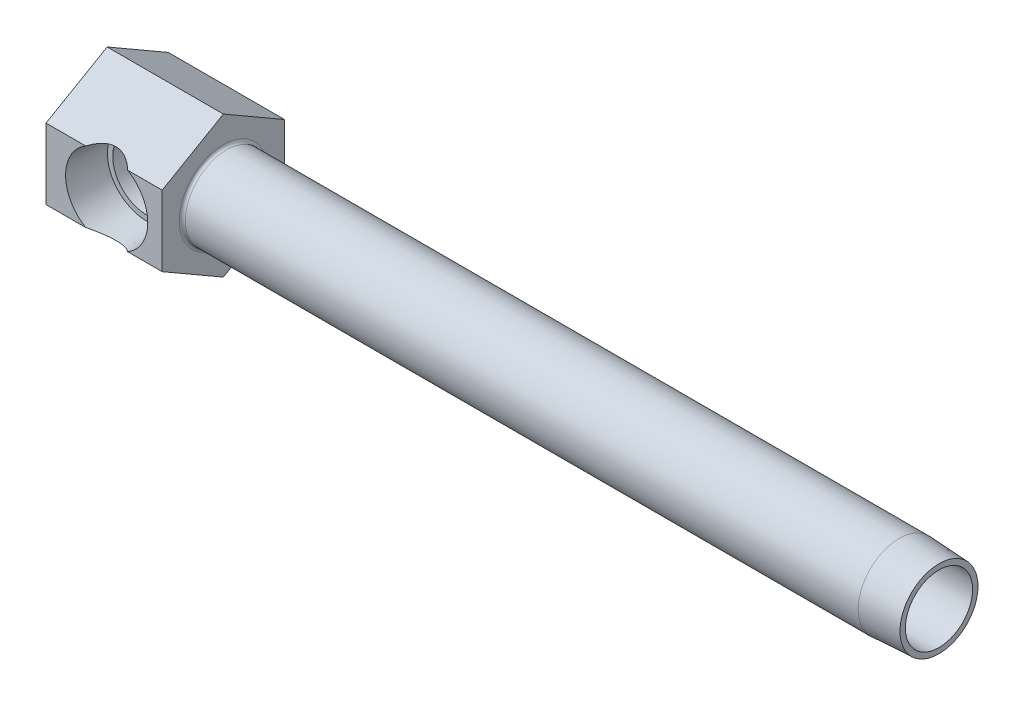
ISO-10303-21;
HEADER;
FILE_DESCRIPTION(('STEP AP214'),'2;1');
FILE_NAME('part.step','',(''),(''),'','','');
FILE_SCHEMA(('AUTOMOTIVE_DESIGN { 1 0 10303 214 1 1 1 1 }'));
ENDSEC;
DATA;
#1=APPLICATION_CONTEXT('core data for automotive mechanical design processes');
#2=APPLICATION_PROTOCOL_DEFINITION('international standard','automotive_design',2000,#1);
#3=PRODUCT_CONTEXT('',#1,'mechanical');
#4=PRODUCT('Part','Part','',(#3));
#5=PRODUCT_RELATED_PRODUCT_CATEGORY('part','',(#4));
#6=PRODUCT_DEFINITION_FORMATION('','',#4);
#7=PRODUCT_DEFINITION_CONTEXT('part definition',#1,'design');
#8=PRODUCT_DEFINITION('design','',#6,#7);
#9=PRODUCT_DEFINITION_SHAPE('','',#8);
#10=(LENGTH_UNIT() NAMED_UNIT(*) SI_UNIT(.MILLI.,.METRE.));
#11=(NAMED_UNIT(*) PLANE_ANGLE_UNIT() SI_UNIT($,.RADIAN.));
#12=(NAMED_UNIT(*) SI_UNIT($,.STERADIAN.) SOLID_ANGLE_UNIT());
#13=UNCERTAINTY_MEASURE_WITH_UNIT(LENGTH_MEASURE(1.E-05),#10,'distance_accuracy_value','');
#14=(GEOMETRIC_REPRESENTATION_CONTEXT(3) GLOBAL_UNCERTAINTY_ASSIGNED_CONTEXT((#13)) GLOBAL_UNIT_ASSIGNED_CONTEXT((#10,
#11,#12)) REPRESENTATION_CONTEXT('',''));
#15=CARTESIAN_POINT('',(0.,0.,0.));
#16=DIRECTION('',(0.,0.,1.));
#17=DIRECTION('',(1.,0.,0.));
#18=AXIS2_PLACEMENT_3D('',#15,#16,#17);
#19=CARTESIAN_POINT('',(63.5,0.,15.875));
#20=DIRECTION('',(-1.,0.,0.));
#21=DIRECTION('',(0.,0.,1.));
#22=AXIS2_PLACEMENT_3D('',#19,#20,#21);
#23=CYLINDRICAL_SURFACE('',#22,10.668);
#24=CARTESIAN_POINT('',(30.9499,0.,15.875));
#25=DIRECTION('',(1.,0.,0.));
#26=DIRECTION('',(0.,1.,0.));
#27=AXIS2_PLACEMENT_3D('',#24,#25,#26);
#28=CIRCLE('',#27,10.668);
#29=CARTESIAN_POINT('',(30.9499,10.668,15.875));
#30=VERTEX_POINT('',#29);
#31=EDGE_CURVE('E191',#30,#30,#28,.T.);
#32=ORIENTED_EDGE('',*,*,#31,.T.);
#33=EDGE_LOOP('',(#32));
#34=FACE_BOUND('',#33,.T.);
#35=CARTESIAN_POINT('',(205.5876,0.,15.875));
#36=DIRECTION('',(1.,0.,0.));
#37=DIRECTION('',(0.,0.,-1.));
#38=AXIS2_PLACEMENT_3D('',#35,#36,#37);
#39=CIRCLE('',#38,10.668);
#40=CARTESIAN_POINT('',(205.5876,0.,5.207));
#41=VERTEX_POINT('',#40);
#42=EDGE_CURVE('E256',#41,#41,#39,.T.);
#43=ORIENTED_EDGE('',*,*,#42,.F.);
#44=EDGE_LOOP('',(#43));
#45=FACE_BOUND('',#44,.T.);
#46=ADVANCED_FACE('F15',(#34,#45),#23,.T.);
#47=CARTESIAN_POINT('',(30.1625,18.3308710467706,15.875));
#48=DIRECTION('',(0.,-0.866025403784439,-0.5));
#49=DIRECTION('',(0.,0.5,-0.866025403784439));
#50=AXIS2_PLACEMENT_3D('',#47,#48,#49);
#51=PLANE('',#50);
#52=CARTESIAN_POINT('',(15.748,-1.05255916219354,49.4480859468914));
#53=DIRECTION('',(0.,-0.866025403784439,-0.5));
#54=DIRECTION('',(0.,-0.5,0.866025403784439));
#55=AXIS2_PLACEMENT_3D('',#52,#53,#54);
#56=ELLIPSE('',#55,23.191034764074,11.5476466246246);
#57=CARTESIAN_POINT('',(21.2070306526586,9.16543552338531,31.75));
#58=VERTEX_POINT('',#57);
#59=CARTESIAN_POINT('',(10.2889693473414,9.16543552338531,31.75));
#60=VERTEX_POINT('',#59);
#61=EDGE_CURVE('E135',#58,#60,#56,.F.);
#62=ORIENTED_EDGE('',*,*,#61,.F.);
#63=DIRECTION('',(-1.,0.,0.));
#64=VECTOR('',#63,1.);
#65=CARTESIAN_POINT('',(30.1625,9.16543552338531,31.75));
#66=LINE('',#65,#64);
#67=CARTESIAN_POINT('',(30.1625,9.16543552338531,31.75));
#68=VERTEX_POINT('',#67);
#69=EDGE_CURVE('E179',#68,#58,#66,.T.);
#70=ORIENTED_EDGE('',*,*,#69,.F.);
#71=DIRECTION('',(0.,-0.5,0.866025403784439));
#72=VECTOR('',#71,1.);
#73=CARTESIAN_POINT('',(30.1625,18.3308710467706,15.875));
#74=LINE('',#73,#72);
#75=CARTESIAN_POINT('',(30.1625,18.3308710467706,15.875));
#76=VERTEX_POINT('',#75);
#77=EDGE_CURVE('E163',#76,#68,#74,.T.);
#78=ORIENTED_EDGE('',*,*,#77,.F.);
#79=DIRECTION('',(-1.,0.,0.));
#80=VECTOR('',#79,1.);
#81=CARTESIAN_POINT('',(30.1625,18.3308710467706,15.875));
#82=LINE('',#81,#80);
#83=CARTESIAN_POINT('',(0.,18.3308710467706,15.875));
#84=VERTEX_POINT('',#83);
#85=EDGE_CURVE('E182',#76,#84,#82,.T.);
#86=ORIENTED_EDGE('',*,*,#85,.T.);
#87=DIRECTION('',(0.,-0.5,0.866025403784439));
#88=VECTOR('',#87,1.);
#89=CARTESIAN_POINT('',(0.,18.3308710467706,15.875));
#90=LINE('',#89,#88);
#91=CARTESIAN_POINT('',(0.,9.16543552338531,31.75));
#92=VERTEX_POINT('',#91);
#93=EDGE_CURVE('E144',#84,#92,#90,.T.);
#94=ORIENTED_EDGE('',*,*,#93,.T.);
#95=EDGE_CURVE('E178',#60,#92,#66,.T.);
#96=ORIENTED_EDGE('',*,*,#95,.F.);
#97=EDGE_LOOP('',(#62,#70,#78,#86,#94,#96));
#98=FACE_BOUND('',#97,.T.);
#99=ADVANCED_FACE('F210',(#98),#51,.F.);
#100=CARTESIAN_POINT('',(30.1625,9.16543552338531,31.75));
#101=DIRECTION('',(0.,0.,-1.));
#102=DIRECTION('',(-1.,0.,0.));
#103=AXIS2_PLACEMENT_3D('',#100,#101,#102);
#104=PLANE('',#103);
#105=CARTESIAN_POINT('',(15.748,0.,31.75));
#106=DIRECTION('',(0.,0.,-1.));
#107=DIRECTION('',(-1.,0.,0.));
#108=AXIS2_PLACEMENT_3D('',#105,#106,#107);
#109=CIRCLE('',#108,10.668);
#110=CARTESIAN_POINT('',(21.2070306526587,-9.1654355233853,31.75));
#111=VERTEX_POINT('',#110);
#112=EDGE_CURVE('E133',#58,#111,#109,.T.);
#113=ORIENTED_EDGE('',*,*,#112,.T.);
#114=DIRECTION('',(-1.,0.,0.));
#115=VECTOR('',#114,1.);
#116=CARTESIAN_POINT('',(30.1625,-9.1654355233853,31.75));
#117=LINE('',#116,#115);
#118=CARTESIAN_POINT('',(30.1625,-9.1654355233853,31.75));
#119=VERTEX_POINT('',#118);
#120=EDGE_CURVE('E175',#119,#111,#117,.T.);
#121=ORIENTED_EDGE('',*,*,#120,.F.);
#122=DIRECTION('',(0.,-1.,0.));
#123=VECTOR('',#122,1.);
#124=CARTESIAN_POINT('',(30.1625,9.16543552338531,31.75));
#125=LINE('',#124,#123);
#126=EDGE_CURVE('E165',#68,#119,#125,.T.);
#127=ORIENTED_EDGE('',*,*,#126,.F.);
#128=ORIENTED_EDGE('',*,*,#69,.T.);
#129=EDGE_LOOP('',(#113,#121,#127,#128));
#130=FACE_BOUND('',#129,.T.);
#131=ADVANCED_FACE('F206',(#130),#104,.F.);
#132=CARTESIAN_POINT('',(10.2889693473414,-9.1654355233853,31.75));
#133=VERTEX_POINT('',#132);
#134=EDGE_CURVE('E40',#133,#60,#109,.T.);
#135=ORIENTED_EDGE('',*,*,#134,.T.);
#136=ORIENTED_EDGE('',*,*,#95,.T.);
#137=DIRECTION('',(0.,-1.,0.));
#138=VECTOR('',#137,1.);
#139=CARTESIAN_POINT('',(0.,9.16543552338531,31.75));
#140=LINE('',#139,#138);
#141=CARTESIAN_POINT('',(0.,-9.1654355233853,31.75));
#142=VERTEX_POINT('',#141);
#143=EDGE_CURVE('E148',#92,#142,#140,.T.);
#144=ORIENTED_EDGE('',*,*,#143,.T.);
#145=EDGE_CURVE('E174',#133,#142,#117,.T.);
#146=ORIENTED_EDGE('',*,*,#145,.F.);
#147=EDGE_LOOP('',(#135,#136,#144,#146));
#148=FACE_BOUND('',#147,.T.);
#149=ADVANCED_FACE('F213',(#148),#104,.F.);
#150=CARTESIAN_POINT('',(30.1625,-9.1654355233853,31.75));
#151=DIRECTION('',(0.,0.866025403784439,-0.5));
#152=DIRECTION('',(0.,0.5,0.866025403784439));
#153=AXIS2_PLACEMENT_3D('',#150,#151,#152);
#154=PLANE('',#153);
#155=CARTESIAN_POINT('',(15.748,1.05255916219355,49.4480859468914));
#156=DIRECTION('',(0.,0.866025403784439,-0.5));
#157=DIRECTION('',(0.,0.5,0.866025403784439));
#158=AXIS2_PLACEMENT_3D('',#155,#156,#157);
#159=ELLIPSE('',#158,23.191034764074,11.5476466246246);
#160=EDGE_CURVE('E26',#133,#111,#159,.F.);
#161=ORIENTED_EDGE('',*,*,#160,.F.);
#162=ORIENTED_EDGE('',*,*,#145,.T.);
#163=DIRECTION('',(0.,-0.5,-0.866025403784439));
#164=VECTOR('',#163,1.);
#165=CARTESIAN_POINT('',(0.,-9.1654355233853,31.75));
#166=LINE('',#165,#164);
#167=CARTESIAN_POINT('',(0.,-18.3308710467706,15.875));
#168=VERTEX_POINT('',#167);
#169=EDGE_CURVE('E152',#142,#168,#166,.T.);
#170=ORIENTED_EDGE('',*,*,#169,.T.);
#171=DIRECTION('',(-1.,0.,0.));
#172=VECTOR('',#171,1.);
#173=CARTESIAN_POINT('',(30.1625,-18.3308710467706,15.875));
#174=LINE('',#173,#172);
#175=CARTESIAN_POINT('',(30.1625,-18.3308710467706,15.875));
#176=VERTEX_POINT('',#175);
#177=EDGE_CURVE('E169',#176,#168,#174,.T.);
#178=ORIENTED_EDGE('',*,*,#177,.F.);
#179=DIRECTION('',(0.,-0.5,-0.866025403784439));
#180=VECTOR('',#179,1.);
#181=CARTESIAN_POINT('',(30.1625,-9.1654355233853,31.75));
#182=LINE('',#181,#180);
#183=EDGE_CURVE('E167',#119,#176,#182,.T.);
#184=ORIENTED_EDGE('',*,*,#183,.F.);
#185=ORIENTED_EDGE('',*,*,#120,.T.);
#186=EDGE_LOOP('',(#161,#162,#170,#178,#184,#185));
#187=FACE_BOUND('',#186,.T.);
#188=ADVANCED_FACE('F202',(#187),#154,.F.);
#189=CARTESIAN_POINT('',(30.1625,-18.3308710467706,15.875));
#190=DIRECTION('',(0.,0.866025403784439,0.5));
#191=DIRECTION('',(0.,-0.5,0.866025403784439));
#192=AXIS2_PLACEMENT_3D('',#189,#190,#191);
#193=PLANE('',#192);
#194=DIRECTION('',(0.,0.5,-0.866025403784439));
#195=VECTOR('',#194,1.);
#196=CARTESIAN_POINT('',(0.,-18.3308710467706,15.875));
#197=LINE('',#196,#195);
#198=CARTESIAN_POINT('',(0.,-9.16543552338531,0.));
#199=VERTEX_POINT('',#198);
#200=EDGE_CURVE('E137',#168,#199,#197,.T.);
#201=ORIENTED_EDGE('',*,*,#200,.T.);
#202=DIRECTION('',(-1.,0.,0.));
#203=VECTOR('',#202,1.);
#204=CARTESIAN_POINT('',(30.1625,-9.16543552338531,0.));
#205=LINE('',#204,#203);
#206=CARTESIAN_POINT('',(30.1625,-9.16543552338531,0.));
#207=VERTEX_POINT('',#206);
#208=EDGE_CURVE('E188',#207,#199,#205,.T.);
#209=ORIENTED_EDGE('',*,*,#208,.F.);
#210=DIRECTION('',(0.,0.5,-0.866025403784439));
#211=VECTOR('',#210,1.);
#212=CARTESIAN_POINT('',(30.1625,-18.3308710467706,15.875));
#213=LINE('',#212,#211);
#214=EDGE_CURVE('E155',#176,#207,#213,.T.);
#215=ORIENTED_EDGE('',*,*,#214,.F.);
#216=ORIENTED_EDGE('',*,*,#177,.T.);
#217=EDGE_LOOP('',(#201,#209,#215,#216));
#218=FACE_BOUND('',#217,.T.);
#219=ADVANCED_FACE('F220',(#218),#193,.F.);
#220=CARTESIAN_POINT('',(30.1625,-9.16543552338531,0.));
#221=DIRECTION('',(0.,0.,1.));
#222=DIRECTION('',(0.,-1.,0.));
#223=AXIS2_PLACEMENT_3D('',#220,#221,#222);
#224=PLANE('',#223);
#225=DIRECTION('',(0.,1.,0.));
#226=VECTOR('',#225,1.);
#227=CARTESIAN_POINT('',(0.,-9.16543552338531,0.));
#228=LINE('',#227,#226);
#229=CARTESIAN_POINT('',(0.,9.16543552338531,0.));
#230=VERTEX_POINT('',#229);
#231=EDGE_CURVE('E138',#199,#230,#228,.T.);
#232=ORIENTED_EDGE('',*,*,#231,.T.);
#233=DIRECTION('',(-1.,0.,0.));
#234=VECTOR('',#233,1.);
#235=CARTESIAN_POINT('',(30.1625,9.16543552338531,0.));
#236=LINE('',#235,#234);
#237=CARTESIAN_POINT('',(30.1625,9.16543552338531,0.));
#238=VERTEX_POINT('',#237);
#239=EDGE_CURVE('E185',#238,#230,#236,.T.);
#240=ORIENTED_EDGE('',*,*,#239,.F.);
#241=DIRECTION('',(0.,1.,0.));
#242=VECTOR('',#241,1.);
#243=CARTESIAN_POINT('',(30.1625,-9.16543552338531,0.));
#244=LINE('',#243,#242);
#245=EDGE_CURVE('E159',#207,#238,#244,.T.);
#246=ORIENTED_EDGE('',*,*,#245,.F.);
#247=ORIENTED_EDGE('',*,*,#208,.T.);
#248=EDGE_LOOP('',(#232,#240,#246,#247));
#249=FACE_BOUND('',#248,.T.);
#250=ADVANCED_FACE('F227',(#249),#224,.F.);
#251=CARTESIAN_POINT('',(30.1625,9.16543552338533,0.));
#252=DIRECTION('',(0.,-0.86602540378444,0.5));
#253=DIRECTION('',(0.,-0.5,-0.86602540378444));
#254=AXIS2_PLACEMENT_3D('',#251,#252,#253);
#255=PLANE('',#254);
#256=DIRECTION('',(0.,0.5,0.86602540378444));
#257=VECTOR('',#256,1.);
#258=CARTESIAN_POINT('',(0.,9.16543552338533,0.));
#259=LINE('',#258,#257);
#260=EDGE_CURVE('E141',#230,#84,#259,.T.);
#261=ORIENTED_EDGE('',*,*,#260,.T.);
#262=ORIENTED_EDGE('',*,*,#85,.F.);
#263=DIRECTION('',(0.,0.5,0.86602540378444));
#264=VECTOR('',#263,1.);
#265=CARTESIAN_POINT('',(30.1625,9.16543552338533,0.));
#266=LINE('',#265,#264);
#267=EDGE_CURVE('E161',#238,#76,#266,.T.);
#268=ORIENTED_EDGE('',*,*,#267,.F.);
#269=ORIENTED_EDGE('',*,*,#239,.T.);
#270=EDGE_LOOP('',(#261,#262,#268,#269));
#271=FACE_BOUND('',#270,.T.);
#272=ADVANCED_FACE('F233',(#271),#255,.F.);
#273=CARTESIAN_POINT('',(30.1625,-9.16543552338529,0.));
#274=DIRECTION('',(1.,0.,0.));
#275=DIRECTION('',(0.,1.,0.));
#276=AXIS2_PLACEMENT_3D('',#273,#274,#275);
#277=PLANE('',#276);
#278=CARTESIAN_POINT('',(30.1625,0.,15.875));
#279=DIRECTION('',(1.,0.,0.));
#280=DIRECTION('',(0.,1.,0.));
#281=AXIS2_PLACEMENT_3D('',#278,#279,#280);
#282=CIRCLE('',#281,11.4554);
#283=CARTESIAN_POINT('',(30.1625,11.4554,15.875));
#284=VERTEX_POINT('',#283);
#285=EDGE_CURVE('E194',#284,#284,#282,.F.);
#286=ORIENTED_EDGE('',*,*,#285,.T.);
#287=EDGE_LOOP('',(#286));
#288=FACE_BOUND('',#287,.T.);
#289=ORIENTED_EDGE('',*,*,#214,.T.);
#290=ORIENTED_EDGE('',*,*,#245,.T.);
#291=ORIENTED_EDGE('',*,*,#267,.T.);
#292=ORIENTED_EDGE('',*,*,#77,.T.);
#293=ORIENTED_EDGE('',*,*,#126,.T.);
#294=ORIENTED_EDGE('',*,*,#183,.T.);
#295=EDGE_LOOP('',(#289,#290,#291,#292,#293,#294));
#296=FACE_BOUND('',#295,.T.);
#297=ADVANCED_FACE('F230',(#288,#296),#277,.T.);
#298=CARTESIAN_POINT('',(0.,-9.16543552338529,0.));
#299=DIRECTION('',(1.,0.,0.));
#300=DIRECTION('',(0.,1.,0.));
#301=AXIS2_PLACEMENT_3D('',#298,#299,#300);
#302=PLANE('',#301);
#303=ORIENTED_EDGE('',*,*,#200,.F.);
#304=ORIENTED_EDGE('',*,*,#169,.F.);
#305=ORIENTED_EDGE('',*,*,#143,.F.);
#306=ORIENTED_EDGE('',*,*,#93,.F.);
#307=ORIENTED_EDGE('',*,*,#260,.F.);
#308=ORIENTED_EDGE('',*,*,#231,.F.);
#309=EDGE_LOOP('',(#303,#304,#305,#306,#307,#308));
#310=FACE_BOUND('',#309,.T.);
#311=ADVANCED_FACE('F222',(#310),#302,.F.);
#312=CARTESIAN_POINT('',(30.9499,0.,15.875));
#313=DIRECTION('',(1.,0.,0.));
#314=DIRECTION('',(0.,1.,0.));
#315=AXIS2_PLACEMENT_3D('',#312,#313,#314);
#316=TOROIDAL_SURFACE('',#315,11.4554,0.7874);
#317=ORIENTED_EDGE('',*,*,#285,.F.);
#318=EDGE_LOOP('',(#317));
#319=FACE_BOUND('',#318,.T.);
#320=ORIENTED_EDGE('',*,*,#31,.F.);
#321=EDGE_LOOP('',(#320));
#322=FACE_BOUND('',#321,.T.);
#323=ADVANCED_FACE('F331',(#319,#322),#316,.F.);
#324=CARTESIAN_POINT('',(15.748,0.,31.75));
#325=DIRECTION('',(0.,0.,1.));
#326=DIRECTION('',(1.,0.,0.));
#327=AXIS2_PLACEMENT_3D('',#324,#325,#326);
#328=CONICAL_SURFACE('',#327,10.668,0.0523598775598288);
#329=CARTESIAN_POINT('',(23.3158678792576,-6.73011387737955,21.4374));
#330=CARTESIAN_POINT('',(23.4600282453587,-6.58213571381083,21.6163914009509));
#331=CARTESIAN_POINT('',(23.6023884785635,-6.42627781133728,21.7904706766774));
#332=CARTESIAN_POINT('',(23.8817354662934,-6.09837401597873,22.1280133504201));
#333=CARTESIAN_POINT('',(24.0187135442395,-5.92630339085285,22.2914598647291));
#334=CARTESIAN_POINT('',(24.2862441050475,-5.56440643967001,22.6077795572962));
#335=CARTESIAN_POINT('',(24.4167288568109,-5.37443622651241,22.7605461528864));
#336=CARTESIAN_POINT('',(24.6677167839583,-4.97815123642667,23.0522714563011));
#337=CARTESIAN_POINT('',(24.7882261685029,-4.77184678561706,23.1912387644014));
#338=CARTESIAN_POINT('',(24.9921660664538,-4.38969848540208,23.4250980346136));
#339=CARTESIAN_POINT('',(25.0779672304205,-4.21696245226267,23.5230096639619));
#340=CARTESIAN_POINT('',(25.2408840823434,-3.86199712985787,23.7082473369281));
#341=CARTESIAN_POINT('',(25.3180018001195,-3.67977007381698,23.7955758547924));
#342=CARTESIAN_POINT('',(25.4621670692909,-3.30686520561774,23.9583559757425));
#343=CARTESIAN_POINT('',(25.529240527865,-3.11621083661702,24.0338381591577));
#344=CARTESIAN_POINT('',(25.6523303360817,-2.72696762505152,24.1720474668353));
#345=CARTESIAN_POINT('',(25.7083523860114,-2.52838293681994,24.2347811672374));
#346=CARTESIAN_POINT('',(25.808749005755,-2.12236093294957,24.3470188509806));
#347=CARTESIAN_POINT('',(25.8530023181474,-1.91485526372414,24.3963851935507));
#348=CARTESIAN_POINT('',(25.9281094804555,-1.49442789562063,24.4800766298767));
#349=CARTESIAN_POINT('',(25.9589631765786,-1.2815061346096,24.5144015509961));
#350=CARTESIAN_POINT('',(26.0065047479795,-0.852126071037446,24.5672608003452));
#351=CARTESIAN_POINT('',(26.023192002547,-0.635667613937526,24.5857944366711));
#352=CARTESIAN_POINT('',(26.0419565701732,-0.201352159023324,24.6066338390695));
#353=CARTESIAN_POINT('',(26.0440358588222,0.0165046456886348,24.6089417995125));
#354=CARTESIAN_POINT('',(26.0342583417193,0.421689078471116,24.5980844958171));
#355=CARTESIAN_POINT('',(26.0242658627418,0.609123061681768,24.5869892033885));
#356=CARTESIAN_POINT('',(25.9935596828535,0.982016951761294,24.552869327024));
#357=CARTESIAN_POINT('',(25.9728460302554,1.16747686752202,24.5298447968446));
#358=CARTESIAN_POINT('',(25.9211099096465,1.53498981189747,24.4722733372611));
#359=CARTESIAN_POINT('',(25.8900948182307,1.71704518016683,24.437734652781));
#360=CARTESIAN_POINT('',(25.8183100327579,2.07675633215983,24.3576745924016));
#361=CARTESIAN_POINT('',(25.7775399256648,2.25441192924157,24.3121527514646));
#362=CARTESIAN_POINT('',(25.6868155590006,2.6047674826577,24.2106610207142));
#363=CARTESIAN_POINT('',(25.6368406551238,2.77745527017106,24.1546676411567));
#364=CARTESIAN_POINT('',(25.5285266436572,3.11671661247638,24.0330221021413));
#365=CARTESIAN_POINT('',(25.4701845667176,3.28328797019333,23.9673665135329));
#366=CARTESIAN_POINT('',(25.2834921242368,3.77365322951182,23.7566792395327));
#367=CARTESIAN_POINT('',(25.1436492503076,4.08744436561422,23.5981203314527));
#368=CARTESIAN_POINT('',(24.8735653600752,4.61896069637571,23.289353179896));
#369=CARTESIAN_POINT('',(24.7480029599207,4.84261456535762,23.1450088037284));
#370=CARTESIAN_POINT('',(24.4850001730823,5.27158893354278,22.8402219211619));
#371=CARTESIAN_POINT('',(24.34754826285,5.47689124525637,22.6797637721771));
#372=CARTESIAN_POINT('',(24.0644488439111,5.86754844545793,22.3458754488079));
#373=CARTESIAN_POINT('',(23.918859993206,6.05302358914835,22.1725357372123));
#374=CARTESIAN_POINT('',(23.6957580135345,6.31733501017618,21.90341371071));
#375=CARTESIAN_POINT('',(23.6206767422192,6.40304815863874,21.8122772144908));
#376=CARTESIAN_POINT('',(23.4691939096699,6.56995442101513,21.6270388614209));
#377=CARTESIAN_POINT('',(23.3927925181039,6.65114811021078,21.5329373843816));
#378=CARTESIAN_POINT('',(23.3158678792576,6.73011387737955,21.4374));
#379=B_SPLINE_CURVE_WITH_KNOTS('',3,(#329,#330,#331,#332,#333,#334,#335,#336,#337,#338,#339,
#340,#341,#342,#343,#344,#345,#346,#347,#348,#349,#350,#351,#352,#353,#354,#355,#356,#357,#358,
#359,#360,#361,#362,#363,#364,#365,#366,#367,#368,#369,#370,#371,#372,#373,#374,#375,#376,#377,
#378),.UNSPECIFIED.,.F.,.F.,(4,2,2,2,2,2,2,2,2,2,2,2,2,2,2,2,2,2,2,2,2,2,2,2,4),(0.,
0.820023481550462,1.64131879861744,2.46989520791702,3.29795193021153,3.94627694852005,
4.59445010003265,5.24092150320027,5.8870585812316,6.53961554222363,7.19217999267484,
7.84477303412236,8.49727781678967,9.06067705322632,9.6240737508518,10.187067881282,
10.7500858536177,11.3143822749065,11.8788794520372,13.0099648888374,13.8917191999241,
14.7743379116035,15.65125682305,16.0888974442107,16.5264822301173),.UNSPECIFIED.);
#380=CARTESIAN_POINT('',(23.3160289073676,-6.72994857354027,21.4376));
#381=VERTEX_POINT('',#380);
#382=CARTESIAN_POINT('',(23.3160289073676,6.72994857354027,21.4376));
#383=VERTEX_POINT('',#382);
#384=EDGE_CURVE('E119',#381,#383,#379,.T.);
#385=ORIENTED_EDGE('',*,*,#384,.F.);
#386=CARTESIAN_POINT('',(15.748,0.,21.4376));
#387=DIRECTION('',(0.,0.,-1.));
#388=DIRECTION('',(-1.,0.,0.));
#389=AXIS2_PLACEMENT_3D('',#386,#387,#388);
#390=CIRCLE('',#389,10.1275500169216);
#391=EDGE_CURVE('E121',#381,#383,#390,.T.);
#392=ORIENTED_EDGE('',*,*,#391,.T.);
#393=EDGE_LOOP('',(#385,#392));
#394=FACE_BOUND('',#393,.T.);
#395=ORIENTED_EDGE('',*,*,#61,.T.);
#396=ORIENTED_EDGE('',*,*,#134,.F.);
#397=ORIENTED_EDGE('',*,*,#160,.T.);
#398=ORIENTED_EDGE('',*,*,#112,.F.);
#399=EDGE_LOOP('',(#395,#396,#397,#398));
#400=FACE_BOUND('',#399,.T.);
#401=ADVANCED_FACE('F196',(#394,#400),#328,.F.);
#402=CARTESIAN_POINT('',(25.8755500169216,0.,21.4376));
#403=DIRECTION('',(0.,0.,1.));
#404=DIRECTION('',(1.,0.,0.));
#405=AXIS2_PLACEMENT_3D('',#402,#403,#404);
#406=PLANE('',#405);
#407=DIRECTION('',(1.,0.,0.));
#408=VECTOR('',#407,1.);
#409=CARTESIAN_POINT('',(86.8155901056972,-6.72994857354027,21.4376));
#410=LINE('',#409,#408);
#411=CARTESIAN_POINT('',(21.3205618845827,-6.72994857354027,21.4376));
#412=VERTEX_POINT('',#411);
#413=EDGE_CURVE('E123',#412,#381,#410,.T.);
#414=ORIENTED_EDGE('',*,*,#413,.F.);
#415=CARTESIAN_POINT('',(15.748,0.,21.4376));
#416=DIRECTION('',(0.,0.,-1.));
#417=DIRECTION('',(-1.,0.,0.));
#418=AXIS2_PLACEMENT_3D('',#415,#416,#417);
#419=CIRCLE('',#418,8.7376);
#420=CARTESIAN_POINT('',(21.3205618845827,6.72994857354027,21.4376));
#421=VERTEX_POINT('',#420);
#422=EDGE_CURVE('E114',#412,#421,#419,.T.);
#423=ORIENTED_EDGE('',*,*,#422,.T.);
#424=DIRECTION('',(1.,0.,0.));
#425=VECTOR('',#424,1.);
#426=CARTESIAN_POINT('',(86.8155901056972,6.72994857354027,21.4376));
#427=LINE('',#426,#425);
#428=EDGE_CURVE('E115',#383,#421,#427,.F.);
#429=ORIENTED_EDGE('',*,*,#428,.F.);
#430=ORIENTED_EDGE('',*,*,#391,.F.);
#431=EDGE_LOOP('',(#414,#423,#429,#430));
#432=FACE_BOUND('',#431,.T.);
#433=ADVANCED_FACE('F316',(#432),#406,.T.);
#434=CARTESIAN_POINT('',(15.748,0.,43.0975954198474));
#435=DIRECTION('',(0.,0.,-1.));
#436=DIRECTION('',(-1.,0.,0.));
#437=AXIS2_PLACEMENT_3D('',#434,#435,#436);
#438=CYLINDRICAL_SURFACE('',#437,8.7376);
#439=CARTESIAN_POINT('',(24.4856,0.,7.14375000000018));
#440=CARTESIAN_POINT('',(24.4855979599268,-0.194584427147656,7.14375204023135));
#441=CARTESIAN_POINT('',(24.4790855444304,-0.389211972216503,7.15026918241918));
#442=CARTESIAN_POINT('',(24.4531687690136,-0.776828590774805,7.17620489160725));
#443=CARTESIAN_POINT('',(24.4337566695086,-0.969816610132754,7.19563120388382));
#444=CARTESIAN_POINT('',(24.3824080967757,-1.35279132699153,7.24701779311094));
#445=CARTESIAN_POINT('',(24.3504484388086,-1.54277178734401,7.27900127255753));
#446=CARTESIAN_POINT('',(24.2746397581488,-1.91800162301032,7.3548673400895));
#447=CARTESIAN_POINT('',(24.230784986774,-2.10324866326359,7.39875568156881));
#448=CARTESIAN_POINT('',(24.1323992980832,-2.46629304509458,7.49721818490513));
#449=CARTESIAN_POINT('',(24.0779544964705,-2.64413729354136,7.55170615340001));
#450=CARTESIAN_POINT('',(23.9590478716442,-2.99304779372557,7.6707093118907));
#451=CARTESIAN_POINT('',(23.8945822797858,-3.16411146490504,7.73522827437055));
#452=CARTESIAN_POINT('',(23.7566100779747,-3.49864884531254,7.87331790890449));
#453=CARTESIAN_POINT('',(23.6831076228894,-3.66212599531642,7.94688442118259));
#454=CARTESIAN_POINT('',(23.5279457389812,-3.98115293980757,8.10218588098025));
#455=CARTESIAN_POINT('',(23.4462844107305,-4.13670087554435,8.18392273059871));
#456=CARTESIAN_POINT('',(23.2407563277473,-4.50158308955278,8.38964777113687));
#457=CARTESIAN_POINT('',(23.1132942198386,-4.7068770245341,8.51723745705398));
#458=CARTESIAN_POINT('',(22.84617651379,-5.10080513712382,8.7846388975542));
#459=CARTESIAN_POINT('',(22.7065197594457,-5.28943773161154,8.92445181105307));
#460=CARTESIAN_POINT('',(22.4166157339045,-5.65057111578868,9.21470277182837));
#461=CARTESIAN_POINT('',(22.2663444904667,-5.82303320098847,9.36516487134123));
#462=CARTESIAN_POINT('',(21.9571971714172,-6.15161912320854,9.67473646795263));
#463=CARTESIAN_POINT('',(21.7983210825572,-6.30774293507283,9.83384597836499));
#464=CARTESIAN_POINT('',(21.410466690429,-6.66146937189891,10.2223222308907));
#465=CARTESIAN_POINT('',(21.1781519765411,-6.85174414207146,10.4550504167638));
#466=CARTESIAN_POINT('',(20.7027527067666,-7.20301910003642,10.9314300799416));
#467=CARTESIAN_POINT('',(20.4596630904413,-7.36400534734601,11.1750866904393));
#468=CARTESIAN_POINT('',(19.9655914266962,-7.65767994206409,11.6705392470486));
#469=CARTESIAN_POINT('',(19.7146188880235,-7.79040098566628,11.922325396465));
#470=CARTESIAN_POINT('',(19.2066974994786,-8.0288054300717,12.432296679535));
#471=CARTESIAN_POINT('',(18.9497514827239,-8.13450137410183,12.6904787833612));
#472=CARTESIAN_POINT('',(18.535849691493,-8.28254836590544,13.1070621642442));
#473=CARTESIAN_POINT('',(18.3802144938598,-8.3332845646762,13.2638590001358));
#474=CARTESIAN_POINT('',(18.0678223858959,-8.42559206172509,13.5791092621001));
#475=CARTESIAN_POINT('',(17.9110652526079,-8.46716148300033,13.7375630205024));
#476=CARTESIAN_POINT('',(17.6309955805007,-8.53322740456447,14.0215802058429));
#477=CARTESIAN_POINT('',(17.5077848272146,-8.5594718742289,14.1468425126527));
#478=CARTESIAN_POINT('',(17.2618022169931,-8.60637337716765,14.3980579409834));
#479=CARTESIAN_POINT('',(17.1390302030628,-8.62704779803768,14.5240076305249));
#480=CARTESIAN_POINT('',(16.9357825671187,-8.65687758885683,14.7346643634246));
#481=CARTESIAN_POINT('',(16.8550481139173,-8.66756378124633,14.8189101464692));
#482=CARTESIAN_POINT('',(16.6937016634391,-8.68665280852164,14.9894220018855));
#483=CARTESIAN_POINT('',(16.6130990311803,-8.6950316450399,15.0756998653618));
#484=CARTESIAN_POINT('',(16.4936864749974,-8.70581636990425,15.2075729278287));
#485=CARTESIAN_POINT('',(16.453897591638,-8.70912835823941,15.2522143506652));
#486=CARTESIAN_POINT('',(16.3753514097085,-8.71513811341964,15.3428639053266));
#487=CARTESIAN_POINT('',(16.336600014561,-8.71783283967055,15.3888775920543));
#488=CARTESIAN_POINT('',(16.2623845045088,-8.72252382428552,15.4819945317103));
#489=CARTESIAN_POINT('',(16.2268715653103,-8.72453249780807,15.5290599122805));
#490=CARTESIAN_POINT('',(16.1615894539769,-8.72786360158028,15.6269900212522));
#491=CARTESIAN_POINT('',(16.1317624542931,-8.72919320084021,15.6778082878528));
#492=CARTESIAN_POINT('',(16.106026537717,-8.73026315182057,15.7432733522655));
#493=CARTESIAN_POINT('',(16.1020065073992,-8.73042652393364,15.7545502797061));
#494=CARTESIAN_POINT('',(16.0948910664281,-8.73071197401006,15.7773932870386));
#495=CARTESIAN_POINT('',(16.0917959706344,-8.73083403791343,15.788959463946));
#496=CARTESIAN_POINT('',(16.0842173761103,-8.7311305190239,15.8238300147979));
#497=CARTESIAN_POINT('',(16.0813461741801,-8.7312389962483,15.8475287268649));
#498=CARTESIAN_POINT('',(16.080808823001,-8.73125946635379,15.8951415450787));
#499=CARTESIAN_POINT('',(16.083177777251,-8.73117013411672,15.9190560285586));
#500=CARTESIAN_POINT('',(16.0925113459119,-8.73080677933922,15.9661053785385));
#501=CARTESIAN_POINT('',(16.099514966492,-8.73053118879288,15.9892318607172));
#502=CARTESIAN_POINT('',(16.1262284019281,-8.72942751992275,16.0598051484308));
#503=CARTESIAN_POINT('',(16.151337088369,-8.7283274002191,16.1050597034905));
#504=CARTESIAN_POINT('',(16.2067600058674,-8.72559491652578,16.1922079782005));
#505=CARTESIAN_POINT('',(16.2371111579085,-8.72395869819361,16.2340745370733));
#506=CARTESIAN_POINT('',(16.3394034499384,-8.71784635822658,16.3674166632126));
#507=CARTESIAN_POINT('',(16.4158450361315,-8.71237926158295,16.4553852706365));
#508=CARTESIAN_POINT('',(16.5713693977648,-8.69907947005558,16.6287851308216));
#509=CARTESIAN_POINT('',(16.6504566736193,-8.69124254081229,16.7142115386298));
#510=CARTESIAN_POINT('',(16.8096315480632,-8.67323190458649,16.8834717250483));
#511=CARTESIAN_POINT('',(16.8897156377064,-8.66306494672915,16.9673093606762));
#512=CARTESIAN_POINT('',(17.0502749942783,-8.64038918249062,17.1341543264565));
#513=CARTESIAN_POINT('',(17.1307499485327,-8.62788201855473,17.2171621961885));
#514=CARTESIAN_POINT('',(17.3707828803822,-8.58710464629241,17.463693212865));
#515=CARTESIAN_POINT('',(17.5305844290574,-8.5553951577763,17.626432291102));
#516=CARTESIAN_POINT('',(17.8496978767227,-8.48264950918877,17.9503078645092));
#517=CARTESIAN_POINT('',(18.0090097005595,-8.44161198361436,18.1114441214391));
#518=CARTESIAN_POINT('',(18.4856528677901,-8.30423407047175,18.592695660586));
#519=CARTESIAN_POINT('',(18.8014587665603,-8.1936672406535,18.9104166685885));
#520=CARTESIAN_POINT('',(19.4255974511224,-7.93318916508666,19.5375986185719));
#521=CARTESIAN_POINT('',(19.7339228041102,-7.78324040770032,19.8470513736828));
#522=CARTESIAN_POINT('',(20.3391141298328,-7.44229907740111,20.4540803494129));
#523=CARTESIAN_POINT('',(20.6359893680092,-7.25134054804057,20.7516661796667));
#524=CARTESIAN_POINT('',(21.1000219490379,-6.910044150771,21.2166598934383));
#525=CARTESIAN_POINT('',(21.2721889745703,-6.7733595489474,21.3891483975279));
#526=CARTESIAN_POINT('',(21.6095045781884,-6.48366113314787,21.7270430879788));
#527=CARTESIAN_POINT('',(21.7746536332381,-6.33064843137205,21.8924497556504));
#528=CARTESIAN_POINT('',(22.2570327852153,-5.84682072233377,22.3755293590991));
#529=CARTESIAN_POINT('',(22.5620480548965,-5.49060305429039,22.6809166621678));
#530=CARTESIAN_POINT('',(23.069916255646,-4.78392446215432,23.1893448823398));
#531=CARTESIAN_POINT('',(23.2811256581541,-4.44561570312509,23.4007639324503));
#532=CARTESIAN_POINT('',(23.5668242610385,-3.90553017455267,23.6867285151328));
#533=CARTESIAN_POINT('',(23.6568667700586,-3.72007663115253,23.7768515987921));
#534=CARTESIAN_POINT('',(23.8252338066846,-3.33876204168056,23.9453649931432));
#535=CARTESIAN_POINT('',(23.9035605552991,-3.14290297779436,24.0237575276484));
#536=CARTESIAN_POINT('',(24.0342740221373,-2.77741093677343,24.1545782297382));
#537=CARTESIAN_POINT('',(24.0887969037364,-2.60930304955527,24.2091448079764));
#538=CARTESIAN_POINT('',(24.1881404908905,-2.26745357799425,24.3085667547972));
#539=CARTESIAN_POINT('',(24.232963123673,-2.0937131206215,24.3534240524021));
#540=CARTESIAN_POINT('',(24.3121701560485,-1.74160557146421,24.4326916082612));
#541=CARTESIAN_POINT('',(24.3465592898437,-1.5632406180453,24.4671066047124));
#542=CARTESIAN_POINT('',(24.4043171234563,-1.20295803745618,24.5249075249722));
#543=CARTESIAN_POINT('',(24.427685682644,-1.02104036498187,24.548293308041));
#544=CARTESIAN_POINT('',(24.463023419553,-0.654283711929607,24.5836569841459));
#545=CARTESIAN_POINT('',(24.4749486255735,-0.46943621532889,24.5955908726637));
#546=CARTESIAN_POINT('',(24.4870048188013,-0.0989697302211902,24.6076558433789));
#547=CARTESIAN_POINT('',(24.4871357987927,0.086649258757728,24.6077869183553));
#548=CARTESIAN_POINT('',(24.4756009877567,0.457153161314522,24.59624371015));
#549=CARTESIAN_POINT('',(24.4639348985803,0.642038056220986,24.5845691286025));
#550=CARTESIAN_POINT('',(24.4290390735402,1.00960102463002,24.5496476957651));
#551=CARTESIAN_POINT('',(24.4058095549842,1.19227913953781,24.5264010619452));
#552=CARTESIAN_POINT('',(24.3499037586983,1.5435978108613,24.4704535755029));
#553=CARTESIAN_POINT('',(24.3178522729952,1.71243875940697,24.4383780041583));
#554=CARTESIAN_POINT('',(24.2443827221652,2.0460500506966,24.3648524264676));
#555=CARTESIAN_POINT('',(24.2029611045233,2.21081882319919,24.3233988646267));
#556=CARTESIAN_POINT('',(24.1113637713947,2.53539687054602,24.231729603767));
#557=CARTESIAN_POINT('',(24.0611880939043,2.69520616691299,24.1815139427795));
#558=CARTESIAN_POINT('',(23.9527394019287,3.0092382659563,24.0729769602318));
#559=CARTESIAN_POINT('',(23.8944647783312,3.16345995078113,24.0146540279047));
#560=CARTESIAN_POINT('',(23.7478576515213,3.52103226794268,23.8679223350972));
#561=CARTESIAN_POINT('',(23.6563189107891,3.72176242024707,23.776303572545));
#562=CARTESIAN_POINT('',(23.4611265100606,4.11105686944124,23.5809334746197));
#563=CARTESIAN_POINT('',(23.3574693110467,4.29961758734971,23.4771785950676));
#564=CARTESIAN_POINT('',(23.1395028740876,4.66439092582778,23.2589969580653));
#565=CARTESIAN_POINT('',(23.0251788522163,4.84058579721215,23.1445553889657));
#566=CARTESIAN_POINT('',(22.7874660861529,5.18020722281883,22.9065848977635));
#567=CARTESIAN_POINT('',(22.6640769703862,5.34363325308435,22.7830556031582));
#568=CARTESIAN_POINT('',(22.3624933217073,5.71583582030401,22.4811084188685));
#569=CARTESIAN_POINT('',(22.1808835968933,5.9190794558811,22.2992637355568));
#570=CARTESIAN_POINT('',(21.8058537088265,6.30238103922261,21.9236994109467));
#571=CARTESIAN_POINT('',(21.6124292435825,6.48243046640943,21.7299754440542));
#572=CARTESIAN_POINT('',(21.2157200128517,6.8203891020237,21.3325794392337));
#573=CARTESIAN_POINT('',(21.0124171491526,6.97825543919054,21.1288891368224));
#574=CARTESIAN_POINT('',(20.5982380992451,7.27223101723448,20.7138083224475));
#575=CARTESIAN_POINT('',(20.3873623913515,7.40834162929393,20.5024182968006));
#576=CARTESIAN_POINT('',(19.884649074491,7.70363293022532,19.9982794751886));
#577=CARTESIAN_POINT('',(19.59030513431,7.85421669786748,19.7029484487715));
#578=CARTESIAN_POINT('',(19.1430322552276,8.05270383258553,19.2536843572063));
#579=CARTESIAN_POINT('',(18.9929116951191,8.11432340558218,19.1028145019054));
#580=CARTESIAN_POINT('',(18.6911065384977,8.2285969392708,18.7992470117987));
#581=CARTESIAN_POINT('',(18.5394220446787,8.28125148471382,18.6465494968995));
#582=CARTESIAN_POINT('',(18.2352261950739,8.37763466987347,18.3399014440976));
#583=CARTESIAN_POINT('',(18.0827174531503,8.42138304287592,18.1859544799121));
#584=CARTESIAN_POINT('',(17.7769311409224,8.5002358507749,17.8765529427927));
#585=CARTESIAN_POINT('',(17.6236534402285,8.53533876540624,17.721098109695));
#586=CARTESIAN_POINT('',(17.3172180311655,8.59695458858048,17.4087584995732));
#587=CARTESIAN_POINT('',(17.164060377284,8.62347694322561,17.2518754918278));
#588=CARTESIAN_POINT('',(16.8589569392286,8.66804695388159,16.935768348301));
#589=CARTESIAN_POINT('',(16.7070105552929,8.68609909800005,16.7765454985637));
#590=CARTESIAN_POINT('',(16.46350407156,8.70877341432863,16.5098735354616));
#591=CARTESIAN_POINT('',(16.3699008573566,8.71589085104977,16.4044258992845));
#592=CARTESIAN_POINT('',(16.2323264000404,8.72430499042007,16.2291085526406));
#593=CARTESIAN_POINT('',(16.1841543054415,8.72679002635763,16.163138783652));
#594=CARTESIAN_POINT('',(16.133496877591,8.729101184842,16.0698810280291));
#595=CARTESIAN_POINT('',(16.1225051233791,8.72957575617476,16.0475182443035));
#596=CARTESIAN_POINT('',(16.1036531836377,8.73036364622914,16.0015173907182));
#597=CARTESIAN_POINT('',(16.0957832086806,8.73067746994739,15.9778835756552));
#598=CARTESIAN_POINT('',(16.0858252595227,8.73106804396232,15.9345234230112));
#599=CARTESIAN_POINT('',(16.0828762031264,8.73118048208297,15.9150042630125));
#600=CARTESIAN_POINT('',(16.0804848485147,8.73127193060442,15.8757632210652));
#601=CARTESIAN_POINT('',(16.0810378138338,8.73125112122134,15.8560416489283));
#602=CARTESIAN_POINT('',(16.085496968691,8.73107971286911,15.8170943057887));
#603=CARTESIAN_POINT('',(16.0893884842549,8.7309296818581,15.7978667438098));
#604=CARTESIAN_POINT('',(16.0998433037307,8.73051484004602,15.7601398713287));
#605=CARTESIAN_POINT('',(16.1064126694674,8.73024976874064,15.7416423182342));
#606=CARTESIAN_POINT('',(16.1364699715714,8.72898749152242,15.6687660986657));
#607=CARTESIAN_POINT('',(16.167275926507,8.72759479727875,15.6175941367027));
#608=CARTESIAN_POINT('',(16.2343481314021,8.72412321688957,15.51885530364));
#609=CARTESIAN_POINT('',(16.2706691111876,8.72203717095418,15.4713327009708));
#610=CARTESIAN_POINT('',(16.3943809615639,8.71408023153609,15.3171540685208));
#611=CARTESIAN_POINT('',(16.4865189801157,8.70682435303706,15.2143256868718));
#612=CARTESIAN_POINT('',(16.6731786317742,8.68900060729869,15.0111482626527));
#613=CARTESIAN_POINT('',(16.7677038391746,8.67842746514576,14.9108034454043));
#614=CARTESIAN_POINT('',(16.9573900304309,8.65402061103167,14.7119565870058));
#615=CARTESIAN_POINT('',(17.0525458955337,8.64020255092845,14.6134480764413));
#616=CARTESIAN_POINT('',(17.2430914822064,8.60927992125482,14.4173129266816));
#617=CARTESIAN_POINT('',(17.3384810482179,8.59217714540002,14.3196858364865));
#618=CARTESIAN_POINT('',(17.7459864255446,8.51203730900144,13.9038911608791));
#619=CARTESIAN_POINT('',(18.0580987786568,8.43292269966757,13.5886112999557));
#620=CARTESIAN_POINT('',(18.6776048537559,8.23825366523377,12.9641986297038));
#621=CARTESIAN_POINT('',(18.9849941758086,8.1226671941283,12.655071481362));
#622=CARTESIAN_POINT('',(19.5923220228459,7.85348929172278,12.0450114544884));
#623=CARTESIAN_POINT('',(19.8922482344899,7.6998391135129,11.744092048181));
#624=CARTESIAN_POINT('',(20.4804833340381,7.35294307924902,11.1542044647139));
#625=CARTESIAN_POINT('',(20.7688011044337,7.15972821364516,10.865227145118));
#626=CARTESIAN_POINT('',(21.2206780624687,6.81483228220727,10.4124550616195));
#627=CARTESIAN_POINT('',(21.3891940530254,6.67617271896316,10.2436383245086));
#628=CARTESIAN_POINT('',(21.7190895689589,6.38282740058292,9.91319894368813));
#629=CARTESIAN_POINT('',(21.8804695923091,6.22814276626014,9.75157579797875));
#630=CARTESIAN_POINT('',(22.3513310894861,5.73984762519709,9.28005235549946));
#631=CARTESIAN_POINT('',(22.6484248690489,5.38133142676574,8.9826055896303));
#632=CARTESIAN_POINT('',(23.141492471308,4.67228730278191,8.48900613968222));
#633=CARTESIAN_POINT('',(23.3459092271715,4.33363653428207,8.2843900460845));
#634=CARTESIAN_POINT('',(23.62145792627,3.79409663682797,8.00858862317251));
#635=CARTESIAN_POINT('',(23.7081391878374,3.60895802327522,7.92183082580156));
#636=CARTESIAN_POINT('',(23.8698120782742,3.2286920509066,7.76001907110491));
#637=CARTESIAN_POINT('',(23.9448062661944,3.03356689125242,7.68496255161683));
#638=CARTESIAN_POINT('',(24.0697191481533,2.66926471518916,7.55994813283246));
#639=CARTESIAN_POINT('',(24.1217294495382,2.50151910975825,7.50789648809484));
#640=CARTESIAN_POINT('',(24.2160793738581,2.16067893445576,7.41347268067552));
#641=CARTESIAN_POINT('',(24.2584209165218,1.98758543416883,7.37109859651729));
#642=CARTESIAN_POINT('',(24.3326749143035,1.63737162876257,7.29678816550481));
#643=CARTESIAN_POINT('',(24.3646094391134,1.46026070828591,7.26482973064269));
#644=CARTESIAN_POINT('',(24.4175977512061,1.10287331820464,7.21180203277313));
#645=CARTESIAN_POINT('',(24.4386569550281,0.922598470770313,7.1907273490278));
#646=CARTESIAN_POINT('',(24.4645620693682,0.61842168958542,7.16480325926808));
#647=CARTESIAN_POINT('',(24.472443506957,0.495022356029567,7.15691607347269));
#648=CARTESIAN_POINT('',(24.48296362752,0.247754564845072,7.14638828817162));
#649=CARTESIAN_POINT('',(24.4856012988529,0.123886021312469,7.14374870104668));
#650=CARTESIAN_POINT('',(24.4856,0.,7.14375000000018));
#651=B_SPLINE_CURVE_WITH_KNOTS('',3,(#439,#440,#441,#442,#443,#444,#445,#446,#447,#448,#449,
#450,#451,#452,#453,#454,#455,#456,#457,#458,#459,#460,#461,#462,#463,#464,#465,#466,#467,#468,
#469,#470,#471,#472,#473,#474,#475,#476,#477,#478,#479,#480,#481,#482,#483,#484,#485,#486,#487,
#488,#489,#490,#491,#492,#493,#494,#495,#496,#497,#498,#499,#500,#501,#502,#503,#504,#505,#506,
#507,#508,#509,#510,#511,#512,#513,#514,#515,#516,#517,#518,#519,#520,#521,#522,#523,#524,#525,
#526,#527,#528,#529,#530,#531,#532,#533,#534,#535,#536,#537,#538,#539,#540,#541,#542,#543,#544,
#545,#546,#547,#548,#549,#550,#551,#552,#553,#554,#555,#556,#557,#558,#559,#560,#561,#562,#563,
#564,#565,#566,#567,#568,#569,#570,#571,#572,#573,#574,#575,#576,#577,#578,#579,#580,#581,#582,
#583,#584,#585,#586,#587,#588,#589,#590,#591,#592,#593,#594,#595,#596,#597,#598,#599,#600,#601,
#602,#603,#604,#605,#606,#607,#608,#609,#610,#611,#612,#613,#614,#615,#616,#617,#618,#619,#620,
#621,#622,#623,#624,#625,#626,#627,#628,#629,#630,#631,#632,#633,#634,#635,#636,#637,#638,#639,
#640,#641,#642,#643,#644,#645,#646,#647,#648,#649,#650),.UNSPECIFIED.,.T.,.F.,(4,2,2,2,2,2,2,2,
2,2,2,2,2,2,2,2,2,2,2,2,2,2,2,2,2,2,2,2,2,2,2,2,2,2,2,2,2,2,2,2,2,2,2,2,2,2,2,2,2,2,2,2,2,2,2,2,
2,2,2,2,2,2,2,2,2,2,2,2,2,2,2,2,2,2,2,2,2,2,2,2,2,2,2,2,2,2,2,2,2,2,2,2,2,2,2,2,2,2,2,2,2,2,2,2,
2,4),(0.,0.583612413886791,1.16757530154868,1.75262232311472,2.3379525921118,2.91870833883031,
3.49968302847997,4.08039159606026,4.66123567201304,5.47979311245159,6.29842824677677,
7.11897529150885,7.93952359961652,9.07759978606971,10.2162162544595,11.3535083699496,
12.4902716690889,13.1701291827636,13.85012577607,14.3830023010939,14.9141955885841,
15.2656970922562,15.62072714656,15.8004033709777,15.9809464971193,16.1580238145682,
16.3331909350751,16.3690696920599,16.4049606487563,16.4760278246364,16.5475725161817,
16.61972713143,16.7737867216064,16.9289791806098,17.2784485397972,17.6285460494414,
17.9776420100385,18.3264938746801,19.0170858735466,19.7077790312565,21.0901665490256,
22.4738756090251,23.8564404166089,24.6940964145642,25.5316953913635,27.2028655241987,
28.5515700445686,29.225841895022,29.8999857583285,30.4543223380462,31.0085486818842,
31.5625231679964,32.1165047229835,32.67260655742,33.2287087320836,33.7848249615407,
34.3409307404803,34.8648402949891,35.3889488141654,35.9130550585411,36.4372655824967,
37.1528654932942,37.8686749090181,38.5854915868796,39.3023376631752,40.2838426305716,
41.265707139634,42.2494438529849,43.2331185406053,44.5610507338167,45.2256261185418,
45.8901581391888,46.5532013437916,47.2163610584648,47.8787882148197,48.5408639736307,
48.964542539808,49.208361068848,49.2829836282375,49.3573702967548,49.4163167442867,
49.4751834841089,49.5337928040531,49.5925355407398,49.7702540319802,49.949867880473,
50.3640564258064,50.7789069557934,51.1917961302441,51.6044604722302,52.9547097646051,
54.3061487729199,55.6596867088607,57.0121684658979,57.8392729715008,58.6663196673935,
60.3161744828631,61.6467920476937,62.3123085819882,62.9776791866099,63.5266629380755,
64.0755375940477,64.6232405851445,65.1706705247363,65.5421672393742,65.9137356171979),.UNSPECIFIED.);
#652=CARTESIAN_POINT('',(23.410585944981,-4.1988606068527,8.21965571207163));
#653=VERTEX_POINT('',#652);
#654=EDGE_CURVE('E104',#653,#412,#651,.T.);
#655=ORIENTED_EDGE('',*,*,#654,.F.);
#656=CARTESIAN_POINT('',(15.748,0.,8.21965571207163));
#657=DIRECTION('',(0.,0.,-1.));
#658=DIRECTION('',(-1.,0.,0.));
#659=AXIS2_PLACEMENT_3D('',#656,#657,#658);
#660=CIRCLE('',#659,8.7376);
#661=CARTESIAN_POINT('',(23.410585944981,4.19886060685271,8.21965571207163));
#662=VERTEX_POINT('',#661);
#663=EDGE_CURVE('E112',#653,#662,#660,.T.);
#664=ORIENTED_EDGE('',*,*,#663,.T.);
#665=EDGE_CURVE('E32',#421,#662,#651,.T.);
#666=ORIENTED_EDGE('',*,*,#665,.F.);
#667=ORIENTED_EDGE('',*,*,#422,.F.);
#668=EDGE_LOOP('',(#655,#664,#666,#667));
#669=FACE_BOUND('',#668,.T.);
#670=ADVANCED_FACE('F111',(#669),#438,.F.);
#671=CARTESIAN_POINT('',(15.748,0.,8.21965571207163));
#672=DIRECTION('',(0.,0.,1.));
#673=DIRECTION('',(1.,0.,0.));
#674=AXIS2_PLACEMENT_3D('',#671,#672,#673);
#675=CONICAL_SURFACE('',#674,8.7376,1.0471975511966);
#676=CARTESIAN_POINT('',(23.4107811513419,4.19922522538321,8.21985571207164));
#677=CARTESIAN_POINT('',(23.367919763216,4.11919395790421,8.17595278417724));
#678=CARTESIAN_POINT('',(23.3270293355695,4.03767589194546,8.13287159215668));
#679=CARTESIAN_POINT('',(23.2492204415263,3.8718198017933,8.04860939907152));
#680=CARTESIAN_POINT('',(23.2123017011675,3.78748197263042,8.00742826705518));
#681=CARTESIAN_POINT('',(23.1076914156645,3.53082485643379,7.8872854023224));
#682=CARTESIAN_POINT('',(23.0459592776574,3.35451271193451,7.81153115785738));
#683=CARTESIAN_POINT('',(22.9381824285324,2.9949771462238,7.67123528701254));
#684=CARTESIAN_POINT('',(22.8919973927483,2.81183308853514,7.60659608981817));
#685=CARTESIAN_POINT('',(22.8127166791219,2.43901153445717,7.48904901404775));
#686=CARTESIAN_POINT('',(22.7796265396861,2.24933131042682,7.43614610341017));
#687=CARTESIAN_POINT('',(22.7225896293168,1.85315874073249,7.34009061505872));
#688=CARTESIAN_POINT('',(22.6993570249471,1.64636373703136,7.29777066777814));
#689=CARTESIAN_POINT('',(22.6626845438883,1.22942523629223,7.2281547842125));
#690=CARTESIAN_POINT('',(22.6492454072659,1.01928148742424,7.20085998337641));
#691=CARTESIAN_POINT('',(22.6302721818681,0.596327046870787,7.16153764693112));
#692=CARTESIAN_POINT('',(22.6247719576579,0.383508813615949,7.14957553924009));
#693=CARTESIAN_POINT('',(22.6209210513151,-0.0424818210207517,7.14125475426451));
#694=CARTESIAN_POINT('',(22.6225699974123,-0.255654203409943,7.14489526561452));
#695=CARTESIAN_POINT('',(22.6333383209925,-0.68327243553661,7.16786503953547));
#696=CARTESIAN_POINT('',(22.6425377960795,-0.897707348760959,7.18736249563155));
#697=CARTESIAN_POINT('',(22.6699228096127,-1.3240495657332,7.24205141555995));
#698=CARTESIAN_POINT('',(22.6881097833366,-1.53595646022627,7.27724538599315));
#699=CARTESIAN_POINT('',(22.7356881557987,-1.95439228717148,7.362629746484));
#700=CARTESIAN_POINT('',(22.765024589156,-2.16094237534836,7.41274631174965));
#701=CARTESIAN_POINT('',(22.8376796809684,-2.56751673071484,7.52712041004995));
#702=CARTESIAN_POINT('',(22.8809887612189,-2.76754536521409,7.59136824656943));
#703=CARTESIAN_POINT('',(22.9613447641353,-3.07251528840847,7.70138682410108));
#704=CARTESIAN_POINT('',(22.9927516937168,-3.18054225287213,7.74283631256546));
#705=CARTESIAN_POINT('',(23.0610067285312,-3.39337844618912,7.82932474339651));
#706=CARTESIAN_POINT('',(23.0978536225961,-3.49818838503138,7.87436288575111));
#707=CARTESIAN_POINT('',(23.1773744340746,-3.70471548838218,7.9678691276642));
#708=CARTESIAN_POINT('',(23.2200768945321,-3.80641431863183,8.01635343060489));
#709=CARTESIAN_POINT('',(23.3111685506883,-4.00587016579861,8.11612059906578));
#710=CARTESIAN_POINT('',(23.3595598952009,-4.10362567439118,8.16740451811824));
#711=CARTESIAN_POINT('',(23.4107811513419,-4.19922522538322,8.21985571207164));
#712=B_SPLINE_CURVE_WITH_KNOTS('',3,(#676,#677,#678,#679,#680,#681,#682,#683,#684,#685,#686,
#687,#688,#689,#690,#691,#692,#693,#694,#695,#696,#697,#698,#699,#700,#701,#702,#703,#704,#705,
#706,#707,#708,#709,#710,#711),.UNSPECIFIED.,.F.,.F.,(4,2,2,2,2,2,2,2,2,2,2,2,2,2,2,2,2,4),(0.,
0.302467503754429,0.604914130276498,1.20849247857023,1.8064670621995,2.40469428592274,
3.04091498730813,3.67718376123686,4.31615869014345,4.9551003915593,5.60090908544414,
6.24682094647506,6.88958900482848,7.53191738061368,7.89140548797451,8.25081367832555,
8.61204058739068,8.97340438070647),.UNSPECIFIED.);
#713=EDGE_CURVE('E10',#662,#653,#712,.T.);
#714=ORIENTED_EDGE('',*,*,#713,.F.);
#715=ORIENTED_EDGE('',*,*,#663,.F.);
#716=EDGE_LOOP('',(#714,#715));
#717=FACE_BOUND('',#716,.T.);
#718=CARTESIAN_POINT('',(15.748,0.,3.17500000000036));
#719=VERTEX_POINT('',#718);
#720=VERTEX_LOOP('',#719);
#721=FACE_BOUND('',#720,.T.);
#722=ADVANCED_FACE('F117',(#717,#721),#675,.F.);
#723=CARTESIAN_POINT('',(86.8155901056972,0.,15.875));
#724=DIRECTION('',(1.,0.,0.));
#725=DIRECTION('',(0.,0.,-1.));
#726=AXIS2_PLACEMENT_3D('',#723,#724,#725);
#727=CYLINDRICAL_SURFACE('',#726,8.73124999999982);
#728=ORIENTED_EDGE('',*,*,#384,.T.);
#729=ORIENTED_EDGE('',*,*,#428,.T.);
#730=ORIENTED_EDGE('',*,*,#665,.T.);
#731=ORIENTED_EDGE('',*,*,#713,.T.);
#732=ORIENTED_EDGE('',*,*,#654,.T.);
#733=ORIENTED_EDGE('',*,*,#413,.T.);
#734=EDGE_LOOP('',(#728,#729,#730,#731,#732,#733));
#735=FACE_BOUND('',#734,.T.);
#736=CARTESIAN_POINT('',(215.9,0.,15.875));
#737=DIRECTION('',(1.,0.,0.));
#738=DIRECTION('',(0.,0.,-1.));
#739=AXIS2_PLACEMENT_3D('',#736,#737,#738);
#740=CIRCLE('',#739,8.73124999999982);
#741=CARTESIAN_POINT('',(215.9,0.,7.14375000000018));
#742=VERTEX_POINT('',#741);
#743=EDGE_CURVE('E261',#742,#742,#740,.T.);
#744=ORIENTED_EDGE('',*,*,#743,.T.);
#745=EDGE_LOOP('',(#744));
#746=FACE_BOUND('',#745,.T.);
#747=ADVANCED_FACE('F102',(#735,#746),#727,.F.);
#748=CARTESIAN_POINT('',(215.9,0.,5.74744998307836));
#749=DIRECTION('',(1.,0.,0.));
#750=DIRECTION('',(0.,0.,-1.));
#751=AXIS2_PLACEMENT_3D('',#748,#749,#750);
#752=PLANE('',#751);
#753=CARTESIAN_POINT('',(215.9,0.,15.875));
#754=DIRECTION('',(1.,0.,0.));
#755=DIRECTION('',(0.,0.,-1.));
#756=AXIS2_PLACEMENT_3D('',#753,#754,#755);
#757=CIRCLE('',#756,10.1275500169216);
#758=CARTESIAN_POINT('',(215.9,0.,5.74744998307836));
#759=VERTEX_POINT('',#758);
#760=EDGE_CURVE('E258',#759,#759,#757,.T.);
#761=ORIENTED_EDGE('',*,*,#760,.T.);
#762=EDGE_LOOP('',(#761));
#763=FACE_BOUND('',#762,.T.);
#764=ORIENTED_EDGE('',*,*,#743,.F.);
#765=EDGE_LOOP('',(#764));
#766=FACE_BOUND('',#765,.T.);
#767=ADVANCED_FACE('F274',(#763,#766),#752,.T.);
#768=CARTESIAN_POINT('',(215.9,0.,15.875));
#769=DIRECTION('',(-1.,0.,0.));
#770=DIRECTION('',(0.,0.,1.));
#771=AXIS2_PLACEMENT_3D('',#768,#769,#770);
#772=CONICAL_SURFACE('',#771,10.1275500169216,0.0523598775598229);
#773=ORIENTED_EDGE('',*,*,#42,.T.);
#774=EDGE_LOOP('',(#773));
#775=FACE_BOUND('',#774,.T.);
#776=ORIENTED_EDGE('',*,*,#760,.F.);
#777=EDGE_LOOP('',(#776));
#778=FACE_BOUND('',#777,.T.);
#779=ADVANCED_FACE('F279',(#775,#778),#772,.T.);
#780=CLOSED_SHELL('',(#46,#99,#131,#149,#188,#219,#250,#272,#297,#311,#323,#401,#433,#670,#722,
#747,#767,#779));
#781=MANIFOLD_SOLID_BREP('B1',#780);
#782=ADVANCED_BREP_SHAPE_REPRESENTATION('',(#18,#781),#14);
#783=SHAPE_DEFINITION_REPRESENTATION(#9,#782);
ENDSEC;
END-ISO-10303-21;
